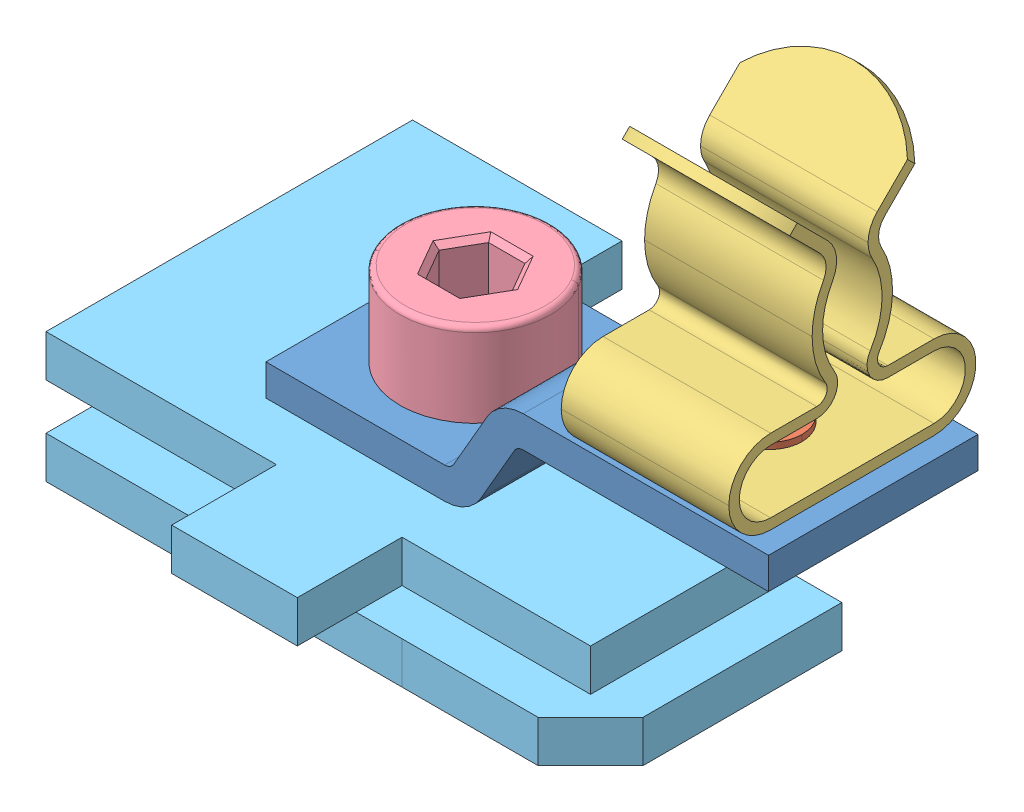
SolidWorks assembly 36253_100.SLDASM, configuration Default (file format 8000). Lengths in mm.
Overall size (32 27.47 22.5).
5 component instances, 5 part files, 0 mates.
Components (placement in the parent):
- 36253_100_01-1: 36253_100_01.SLDPRT [Default] at origin size (24 5.5 10)
- 36253_100_02-1: 36253_100_02.SLDPRT [Default] at origin size (6 3.3 6)
- 36253_100_03-1: 36253_100_03.SLDPRT [Default] at origin size (8 13.47 11.8)
- 36253_100_04-1: 36253_100_04.SLDPRT [Default] at origin size (7.2 14 7.2)
- 36253_100_05-1: 36253_100_05.SLDPRT [Default] at origin size (26 6.2 22.5)
